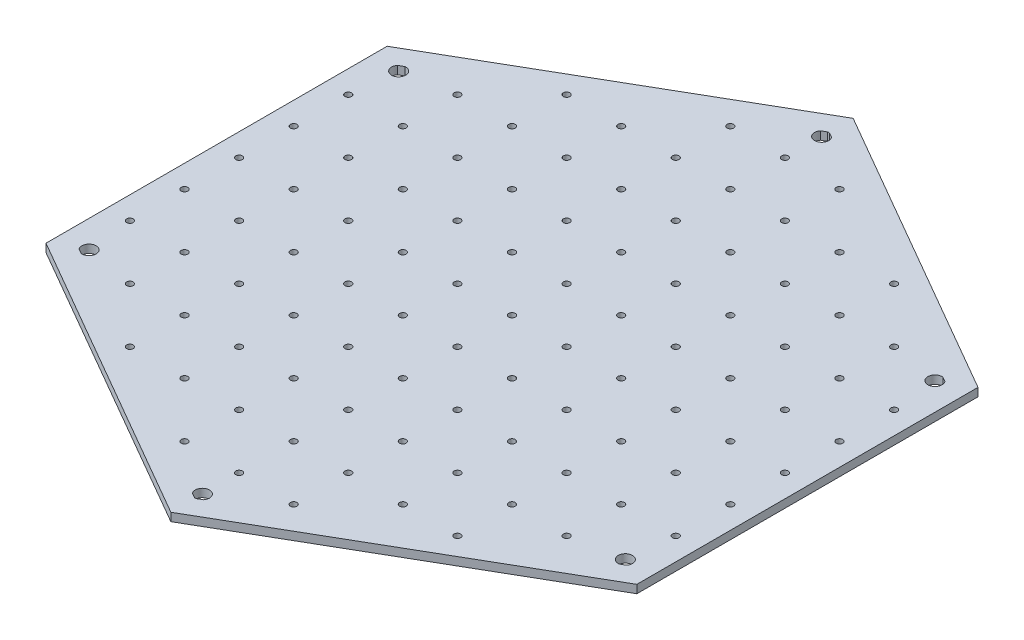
from build123d import *

# Parameters (mm, degrees)
BOSS_EXTRUDE1_DEPTH        = 1.5
SKETCH2_R                  = 0.6
CUT_EXTRUDE1_DEPTH         = 83.693334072
LPATTERN1_COUNT            = 6
LPATTERN1_PITCH            = 10
MIRROR1_COPY_1_SKETCH_R    = 0.6
MIRROR1_COPY_1_DEPTH       = 83.693334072
MIRROR1_COPY_2_SKETCH_R    = 0.6
MIRROR1_COPY_2_DEPTH       = 83.693334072
MIRROR1_COPY_3_SKETCH_R    = 0.6
MIRROR1_COPY_3_DEPTH       = 83.693334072
MIRROR1_COPY_4_SKETCH_R    = 0.6
MIRROR1_COPY_4_DEPTH       = 83.693334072
MIRROR1_COPY_5_SKETCH_R    = 0.6
MIRROR1_COPY_5_DEPTH       = 83.693334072
MIRROR1_COPY_6_SKETCH_R    = 0.6
MIRROR1_COPY_6_DEPTH       = 83.693334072
LPATTERN2_COPY_1_SKETCH_R  = 0.6
LPATTERN2_COPY_1_DEPTH     = 83.693334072
LPATTERN2_COPY_2_SKETCH_R  = 0.6
LPATTERN2_COPY_2_DEPTH     = 83.693334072
LPATTERN2_COPY_3_SKETCH_R  = 0.6
LPATTERN2_COPY_3_DEPTH     = 83.693334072
LPATTERN2_COPY_4_SKETCH_R  = 0.6
LPATTERN2_COPY_4_DEPTH     = 83.693334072
LPATTERN2_COPY_5_SKETCH_R  = 0.6
LPATTERN2_COPY_5_DEPTH     = 83.693334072
LPATTERN2_COPY_6_SKETCH_R  = 0.6
LPATTERN2_COPY_6_DEPTH     = 83.693334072
LPATTERN2_COPY_7_SKETCH_R  = 0.6
LPATTERN2_COPY_7_DEPTH     = 83.693334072
LPATTERN2_COPY_8_SKETCH_R  = 0.6
LPATTERN2_COPY_8_DEPTH     = 83.693334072
LPATTERN2_COPY_9_SKETCH_R  = 0.6
LPATTERN2_COPY_9_DEPTH     = 83.693334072
LPATTERN2_COPY_10_SKETCH_R = 0.6
LPATTERN2_COPY_10_DEPTH    = 83.693334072
LPATTERN2_COPY_11_SKETCH_R = 0.6
LPATTERN2_COPY_11_DEPTH    = 83.693334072
LPATTERN2_COPY_12_SKETCH_R = 0.6
LPATTERN2_COPY_12_DEPTH    = 83.693334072
LPATTERN2_COPY_13_SKETCH_R = 0.6
LPATTERN2_COPY_13_DEPTH    = 83.693334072
LPATTERN2_COPY_14_SKETCH_R = 0.6
LPATTERN2_COPY_14_DEPTH    = 83.693334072
LPATTERN2_COPY_15_SKETCH_R = 0.6
LPATTERN2_COPY_15_DEPTH    = 83.693334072
LPATTERN2_COPY_16_SKETCH_R = 0.6
LPATTERN2_COPY_16_DEPTH    = 83.693334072
LPATTERN2_COPY_17_SKETCH_R = 0.6
LPATTERN2_COPY_17_DEPTH    = 83.693334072
LPATTERN2_COPY_18_SKETCH_R = 0.6
LPATTERN2_COPY_18_DEPTH    = 83.693334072
LPATTERN2_COPY_19_SKETCH_R = 0.6
LPATTERN2_COPY_19_DEPTH    = 83.693334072
LPATTERN2_COPY_20_SKETCH_R = 0.6
LPATTERN2_COPY_20_DEPTH    = 83.693334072
LPATTERN2_COPY_21_SKETCH_R = 0.6
LPATTERN2_COPY_21_DEPTH    = 83.693334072
LPATTERN2_COPY_22_SKETCH_R = 0.6
LPATTERN2_COPY_22_DEPTH    = 83.693334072
LPATTERN2_COPY_23_SKETCH_R = 0.6
LPATTERN2_COPY_23_DEPTH    = 83.693334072
LPATTERN2_COPY_24_SKETCH_R = 0.6
LPATTERN2_COPY_24_DEPTH    = 83.693334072
LPATTERN2_COPY_25_SKETCH_R = 0.6
LPATTERN2_COPY_25_DEPTH    = 83.693334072
LPATTERN2_COPY_26_SKETCH_R = 0.6
LPATTERN2_COPY_26_DEPTH    = 83.693334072
LPATTERN2_COPY_27_SKETCH_R = 0.6
LPATTERN2_COPY_27_DEPTH    = 83.693334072
LPATTERN2_COPY_28_SKETCH_R = 0.6
LPATTERN2_COPY_28_DEPTH    = 83.693334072
LPATTERN2_COPY_29_SKETCH_R = 0.6
LPATTERN2_COPY_29_DEPTH    = 83.693334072
LPATTERN2_COPY_30_SKETCH_R = 0.6
LPATTERN2_COPY_30_DEPTH    = 83.693334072
LPATTERN2_COPY_31_SKETCH_R = 0.6
LPATTERN2_COPY_31_DEPTH    = 83.693334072
LPATTERN2_COPY_32_SKETCH_R = 0.6
LPATTERN2_COPY_32_DEPTH    = 83.693334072
LPATTERN2_COPY_33_SKETCH_R = 0.6
LPATTERN2_COPY_33_DEPTH    = 83.693334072
LPATTERN2_COPY_34_SKETCH_R = 0.6
LPATTERN2_COPY_34_DEPTH    = 83.693334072
LPATTERN2_COPY_35_SKETCH_R = 0.6
LPATTERN2_COPY_35_DEPTH    = 83.693334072
LPATTERN2_COPY_36_SKETCH_R = 0.6
LPATTERN2_COPY_36_DEPTH    = 83.693334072
LPATTERN2_COPY_37_SKETCH_R = 0.6
LPATTERN2_COPY_37_DEPTH    = 83.693334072
LPATTERN2_COPY_38_SKETCH_R = 0.6
LPATTERN2_COPY_38_DEPTH    = 83.693334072
LPATTERN2_COPY_39_SKETCH_R = 0.6
LPATTERN2_COPY_39_DEPTH    = 83.693334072
LPATTERN2_COPY_40_SKETCH_R = 0.6
LPATTERN2_COPY_40_DEPTH    = 83.693334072
LPATTERN2_COPY_41_SKETCH_R = 0.6
LPATTERN2_COPY_41_DEPTH    = 83.693334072
LPATTERN2_COPY_42_SKETCH_R = 0.6
LPATTERN2_COPY_42_DEPTH    = 83.693334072
LPATTERN2_COPY_43_SKETCH_R = 0.6
LPATTERN2_COPY_43_DEPTH    = 83.693334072
LPATTERN2_COPY_44_SKETCH_R = 0.6
LPATTERN2_COPY_44_DEPTH    = 83.693334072
LPATTERN2_COPY_45_SKETCH_R = 0.6
LPATTERN2_COPY_45_DEPTH    = 83.693334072
LPATTERN2_COPY_46_SKETCH_R = 0.6
LPATTERN2_COPY_46_DEPTH    = 83.693334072
LPATTERN2_COPY_47_SKETCH_R = 0.6
LPATTERN2_COPY_47_DEPTH    = 83.693334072
LPATTERN2_COPY_48_SKETCH_R = 0.6
LPATTERN2_COPY_48_DEPTH    = 83.693334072
LPATTERN2_COPY_49_SKETCH_R = 0.6
LPATTERN2_COPY_49_DEPTH    = 83.693334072
LPATTERN2_COPY_50_SKETCH_R = 0.6
LPATTERN2_COPY_50_DEPTH    = 83.693334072
LPATTERN2_COPY_51_SKETCH_R = 0.6
LPATTERN2_COPY_51_DEPTH    = 83.693334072
LPATTERN2_COPY_52_SKETCH_R = 0.6
LPATTERN2_COPY_52_DEPTH    = 83.693334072
LPATTERN2_COPY_53_SKETCH_R = 0.6
LPATTERN2_COPY_53_DEPTH    = 83.693334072
LPATTERN2_COPY_54_SKETCH_R = 0.6
LPATTERN2_COPY_54_DEPTH    = 83.693334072
LPATTERN2_COPY_55_SKETCH_R = 0.6
LPATTERN2_COPY_55_DEPTH    = 83.693334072
LPATTERN2_COPY_56_SKETCH_R = 0.6
LPATTERN2_COPY_56_DEPTH    = 83.693334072
LPATTERN2_COPY_57_SKETCH_R = 0.6
LPATTERN2_COPY_57_DEPTH    = 83.693334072
LPATTERN2_COPY_58_SKETCH_R = 0.6
LPATTERN2_COPY_58_DEPTH    = 83.693334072
LPATTERN2_COPY_59_SKETCH_R = 0.6
LPATTERN2_COPY_59_DEPTH    = 83.693334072
LPATTERN2_COPY_60_SKETCH_R = 0.6
LPATTERN2_COPY_60_DEPTH    = 83.693334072
LPATTERN2_COPY_61_SKETCH_R = 0.6
LPATTERN2_COPY_61_DEPTH    = 83.693334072
LPATTERN2_COPY_62_SKETCH_R = 0.6
LPATTERN2_COPY_62_DEPTH    = 83.693334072
LPATTERN2_COPY_63_SKETCH_R = 0.6
LPATTERN2_COPY_63_DEPTH    = 83.693334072
LPATTERN2_COPY_64_SKETCH_R = 0.6
LPATTERN2_COPY_64_DEPTH    = 83.693334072
LPATTERN2_COPY_65_SKETCH_R = 0.6
LPATTERN2_COPY_65_DEPTH    = 83.693334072
LPATTERN2_COPY_66_SKETCH_R = 0.6
LPATTERN2_COPY_66_DEPTH    = 83.693334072
LPATTERN2_COPY_67_SKETCH_R = 0.6
LPATTERN2_COPY_67_DEPTH    = 83.693334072
LPATTERN2_COPY_68_SKETCH_R = 0.6
LPATTERN2_COPY_68_DEPTH    = 83.693334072
LPATTERN2_COPY_69_SKETCH_R = 0.6
LPATTERN2_COPY_69_DEPTH    = 83.693334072
LPATTERN2_COPY_70_SKETCH_R = 0.6
LPATTERN2_COPY_70_DEPTH    = 83.693334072
LPATTERN2_COPY_71_SKETCH_R = 0.6
LPATTERN2_COPY_71_DEPTH    = 83.693334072
LPATTERN2_COPY_72_SKETCH_R = 0.6
LPATTERN2_COPY_72_DEPTH    = 83.693334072
LPATTERN2_COPY_73_SKETCH_R = 0.6
LPATTERN2_COPY_73_DEPTH    = 83.693334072
LPATTERN2_COPY_74_SKETCH_R = 0.6
LPATTERN2_COPY_74_DEPTH    = 83.693334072
LPATTERN2_COPY_75_SKETCH_R = 0.6
LPATTERN2_COPY_75_DEPTH    = 83.693334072
LPATTERN2_COPY_76_SKETCH_R = 0.6
LPATTERN2_COPY_76_DEPTH    = 83.693334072
LPATTERN2_COPY_77_SKETCH_R = 0.6
LPATTERN2_COPY_77_DEPTH    = 83.693334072
LPATTERN2_COPY_78_SKETCH_R = 0.6
LPATTERN2_COPY_78_DEPTH    = 83.693334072
MIRROR2_COPY_1_SKETCH_R    = 0.6
MIRROR2_COPY_1_DEPTH       = 83.693334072
MIRROR2_COPY_2_SKETCH_R    = 0.6
MIRROR2_COPY_2_DEPTH       = 83.693334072
MIRROR2_COPY_3_SKETCH_R    = 0.6
MIRROR2_COPY_3_DEPTH       = 83.693334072
MIRROR2_COPY_4_SKETCH_R    = 0.6
MIRROR2_COPY_4_DEPTH       = 83.693334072
MIRROR2_COPY_5_SKETCH_R    = 0.6
MIRROR2_COPY_5_DEPTH       = 83.693334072
MIRROR2_COPY_6_SKETCH_R    = 0.6
MIRROR2_COPY_6_DEPTH       = 83.693334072
MIRROR2_COPY_7_SKETCH_R    = 0.6
MIRROR2_COPY_7_DEPTH       = 83.693334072
MIRROR2_COPY_8_SKETCH_R    = 0.6
MIRROR2_COPY_8_DEPTH       = 83.693334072
MIRROR2_COPY_9_SKETCH_R    = 0.6
MIRROR2_COPY_9_DEPTH       = 83.693334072
MIRROR2_COPY_10_SKETCH_R   = 0.6
MIRROR2_COPY_10_DEPTH      = 83.693334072
MIRROR2_COPY_11_SKETCH_R   = 0.6
MIRROR2_COPY_11_DEPTH      = 83.693334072
MIRROR2_COPY_12_SKETCH_R   = 0.6
MIRROR2_COPY_12_DEPTH      = 83.693334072
MIRROR2_COPY_13_SKETCH_R   = 0.6
MIRROR2_COPY_13_DEPTH      = 83.693334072
MIRROR2_COPY_14_SKETCH_R   = 0.6
MIRROR2_COPY_14_DEPTH      = 83.693334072
MIRROR2_COPY_15_SKETCH_R   = 0.6
MIRROR2_COPY_15_DEPTH      = 83.693334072
MIRROR2_COPY_16_SKETCH_R   = 0.6
MIRROR2_COPY_16_DEPTH      = 83.693334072
MIRROR2_COPY_17_SKETCH_R   = 0.6
MIRROR2_COPY_17_DEPTH      = 83.693334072
MIRROR2_COPY_18_SKETCH_R   = 0.6
MIRROR2_COPY_18_DEPTH      = 83.693334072
MIRROR2_COPY_19_SKETCH_R   = 0.6
MIRROR2_COPY_19_DEPTH      = 83.693334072
MIRROR2_COPY_20_SKETCH_R   = 0.6
MIRROR2_COPY_20_DEPTH      = 83.693334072
MIRROR2_COPY_21_SKETCH_R   = 0.6
MIRROR2_COPY_21_DEPTH      = 83.693334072
MIRROR2_COPY_22_SKETCH_R   = 0.6
MIRROR2_COPY_22_DEPTH      = 83.693334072
MIRROR2_COPY_23_SKETCH_R   = 0.6
MIRROR2_COPY_23_DEPTH      = 83.693334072
MIRROR2_COPY_24_SKETCH_R   = 0.6
MIRROR2_COPY_24_DEPTH      = 83.693334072
MIRROR2_COPY_25_SKETCH_R   = 0.6
MIRROR2_COPY_25_DEPTH      = 83.693334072
MIRROR2_COPY_26_SKETCH_R   = 0.6
MIRROR2_COPY_26_DEPTH      = 83.693334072
MIRROR2_COPY_27_SKETCH_R   = 0.6
MIRROR2_COPY_27_DEPTH      = 83.693334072
MIRROR2_COPY_28_SKETCH_R   = 0.6
MIRROR2_COPY_28_DEPTH      = 83.693334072
MIRROR2_COPY_29_SKETCH_R   = 0.6
MIRROR2_COPY_29_DEPTH      = 83.693334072
MIRROR2_COPY_30_SKETCH_R   = 0.6
MIRROR2_COPY_30_DEPTH      = 83.693334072
MIRROR2_COPY_31_SKETCH_R   = 0.6
MIRROR2_COPY_31_DEPTH      = 83.693334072
MIRROR2_COPY_32_SKETCH_R   = 0.6
MIRROR2_COPY_32_DEPTH      = 83.693334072
MIRROR2_COPY_33_SKETCH_R   = 0.6
MIRROR2_COPY_33_DEPTH      = 83.693334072
MIRROR2_COPY_34_SKETCH_R   = 0.6
MIRROR2_COPY_34_DEPTH      = 83.693334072
MIRROR2_COPY_35_SKETCH_R   = 0.6
MIRROR2_COPY_35_DEPTH      = 83.693334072
MIRROR2_COPY_36_SKETCH_R   = 0.6
MIRROR2_COPY_36_DEPTH      = 83.693334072
MIRROR2_COPY_37_SKETCH_R   = 0.6
MIRROR2_COPY_37_DEPTH      = 83.693334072
MIRROR2_COPY_38_SKETCH_R   = 0.6
MIRROR2_COPY_38_DEPTH      = 83.693334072
MIRROR2_COPY_39_SKETCH_R   = 0.6
MIRROR2_COPY_39_DEPTH      = 83.693334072
MIRROR2_COPY_40_SKETCH_R   = 0.6
MIRROR2_COPY_40_DEPTH      = 83.693334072
MIRROR2_COPY_41_SKETCH_R   = 0.6
MIRROR2_COPY_41_DEPTH      = 83.693334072
MIRROR2_COPY_42_SKETCH_R   = 0.6
MIRROR2_COPY_42_DEPTH      = 83.693334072
MIRROR2_COPY_43_SKETCH_R   = 0.6
MIRROR2_COPY_43_DEPTH      = 83.693334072
MIRROR2_COPY_44_SKETCH_R   = 0.6
MIRROR2_COPY_44_DEPTH      = 83.693334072
MIRROR2_COPY_45_SKETCH_R   = 0.6
MIRROR2_COPY_45_DEPTH      = 83.693334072
MIRROR2_COPY_46_SKETCH_R   = 0.6
MIRROR2_COPY_46_DEPTH      = 83.693334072
MIRROR2_COPY_47_SKETCH_R   = 0.6
MIRROR2_COPY_47_DEPTH      = 83.693334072
MIRROR2_COPY_48_SKETCH_R   = 0.6
MIRROR2_COPY_48_DEPTH      = 83.693334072
MIRROR2_COPY_49_SKETCH_R   = 0.6
MIRROR2_COPY_49_DEPTH      = 83.693334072
MIRROR2_COPY_50_SKETCH_R   = 0.6
MIRROR2_COPY_50_DEPTH      = 83.693334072
MIRROR2_COPY_51_SKETCH_R   = 0.6
MIRROR2_COPY_51_DEPTH      = 83.693334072
MIRROR2_COPY_52_SKETCH_R   = 0.6
MIRROR2_COPY_52_DEPTH      = 83.693334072
MIRROR2_COPY_53_SKETCH_R   = 0.6
MIRROR2_COPY_53_DEPTH      = 83.693334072
MIRROR2_COPY_54_SKETCH_R   = 0.6
MIRROR2_COPY_54_DEPTH      = 83.693334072
MIRROR2_COPY_55_SKETCH_R   = 0.6
MIRROR2_COPY_55_DEPTH      = 83.693334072
MIRROR2_COPY_56_SKETCH_R   = 0.6
MIRROR2_COPY_56_DEPTH      = 83.693334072
MIRROR2_COPY_57_SKETCH_R   = 0.6
MIRROR2_COPY_57_DEPTH      = 83.693334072
MIRROR2_COPY_58_SKETCH_R   = 0.6
MIRROR2_COPY_58_DEPTH      = 83.693334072
MIRROR2_COPY_59_SKETCH_R   = 0.6
MIRROR2_COPY_59_DEPTH      = 83.693334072
MIRROR2_COPY_60_SKETCH_R   = 0.6
MIRROR2_COPY_60_DEPTH      = 83.693334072
MIRROR2_COPY_61_SKETCH_R   = 0.6
MIRROR2_COPY_61_DEPTH      = 83.693334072
MIRROR2_COPY_62_SKETCH_R   = 0.6
MIRROR2_COPY_62_DEPTH      = 83.693334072
MIRROR2_COPY_63_SKETCH_R   = 0.6
MIRROR2_COPY_63_DEPTH      = 83.693334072
MIRROR2_COPY_64_SKETCH_R   = 0.6
MIRROR2_COPY_64_DEPTH      = 83.693334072
MIRROR2_COPY_65_SKETCH_R   = 0.6
MIRROR2_COPY_65_DEPTH      = 83.693334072
MIRROR2_COPY_66_SKETCH_R   = 0.6
MIRROR2_COPY_66_DEPTH      = 83.693334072
MIRROR2_COPY_67_SKETCH_R   = 0.6
MIRROR2_COPY_67_DEPTH      = 83.693334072
MIRROR2_COPY_68_SKETCH_R   = 0.6
MIRROR2_COPY_68_DEPTH      = 83.693334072
MIRROR2_COPY_69_SKETCH_R   = 0.6
MIRROR2_COPY_69_DEPTH      = 83.693334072
MIRROR2_COPY_70_SKETCH_R   = 0.6
MIRROR2_COPY_70_DEPTH      = 83.693334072
MIRROR2_COPY_71_SKETCH_R   = 0.6
MIRROR2_COPY_71_DEPTH      = 83.693334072
MIRROR2_COPY_72_SKETCH_R   = 0.6
MIRROR2_COPY_72_DEPTH      = 83.693334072
MIRROR2_COPY_73_SKETCH_R   = 0.6
MIRROR2_COPY_73_DEPTH      = 83.693334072
MIRROR2_COPY_74_SKETCH_R   = 0.6
MIRROR2_COPY_74_DEPTH      = 83.693334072
MIRROR2_COPY_75_SKETCH_R   = 0.6
MIRROR2_COPY_75_DEPTH      = 83.693334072
MIRROR2_COPY_76_SKETCH_R   = 0.6
MIRROR2_COPY_76_DEPTH      = 83.693334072
MIRROR2_COPY_77_SKETCH_R   = 0.6
MIRROR2_COPY_77_DEPTH      = 83.693334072
MIRROR2_COPY_78_SKETCH_R   = 0.6
MIRROR2_COPY_78_DEPTH      = 83.693334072
MIRROR2_COPY_79_SKETCH_R   = 0.6
MIRROR2_COPY_79_DEPTH      = 83.693334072
SKETCH4_R                  = 1.3
CUT_EXTRUDE3_DEPTH         = 83.693334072
BOSS_EXTRUDE2_DEPTH        = 1.5
BOSS_EXTRUDE3_DEPTH        = 1.5
BOSS_EXTRUDE4_DEPTH        = 1.5


with BuildPart() as part:
    # Sketch1 → Boss-Extrude1 (new body)
    with BuildSketch(Plane(origin=(0, 0, 0), x_dir=(1, 0, 0), z_dir=(0, 1, 0))):
        Polygon((0, 62.5), (-54.126587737, 31.25), (-54.126587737, -31.25), (0, -62.5), (54.126587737, -31.25), (54.126587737, 31.25), align=None)
    extrude(amount=BOSS_EXTRUDE1_DEPTH)

    # Sketch2 → Cut-Extrude1 (cut, through all)
    with BuildSketch(Plane(origin=(0, 1.5, 0), x_dir=(1, 0, 0), z_dir=(0, 1, 0))):
        with Locations(Location((0, 0, 0), (0, 0, 270))):
            Circle(SKETCH2_R)
    cut_extrude1 = extrude(amount=-CUT_EXTRUDE1_DEPTH, mode=Mode.SUBTRACT)

    # LPattern1: Cut-Extrude1 ×6
    with Locations(*[(-i * LPATTERN1_PITCH, 0, 0) for i in range(1, LPATTERN1_COUNT)]):
        add(cut_extrude1, mode=Mode.SUBTRACT)

    # Mirror1 copy 1 sketch → Mirror1 copy 1 (cut, through all)
    with BuildSketch(Plane(origin=(10, 1.5, 0), x_dir=(-1, 0, 0), z_dir=(0, 1, 0))):
        Circle(MIRROR1_COPY_1_SKETCH_R)
    extrude(amount=-MIRROR1_COPY_1_DEPTH, mode=Mode.SUBTRACT)

    # Mirror1 copy 2 sketch → Mirror1 copy 2 (cut, through all)
    with BuildSketch(Plane(origin=(20, 1.5, 0), x_dir=(-1, 0, 0), z_dir=(0, 1, 0))):
        Circle(MIRROR1_COPY_2_SKETCH_R)
    extrude(amount=-MIRROR1_COPY_2_DEPTH, mode=Mode.SUBTRACT)

    # Mirror1 copy 3 sketch → Mirror1 copy 3 (cut, through all)
    with BuildSketch(Plane(origin=(30, 1.5, 0), x_dir=(-1, 0, 0), z_dir=(0, 1, 0))):
        Circle(MIRROR1_COPY_3_SKETCH_R)
    extrude(amount=-MIRROR1_COPY_3_DEPTH, mode=Mode.SUBTRACT)

    # Mirror1 copy 4 sketch → Mirror1 copy 4 (cut, through all)
    with BuildSketch(Plane(origin=(40, 1.5, 0), x_dir=(-1, 0, 0), z_dir=(0, 1, 0))):
        Circle(MIRROR1_COPY_4_SKETCH_R)
    extrude(amount=-MIRROR1_COPY_4_DEPTH, mode=Mode.SUBTRACT)

    # Mirror1 copy 5 sketch → Mirror1 copy 5 (cut, through all)
    with BuildSketch(Plane(origin=(50, 1.5, 0), x_dir=(-1, 0, 0), z_dir=(0, 1, 0))):
        Circle(MIRROR1_COPY_5_SKETCH_R)
    extrude(amount=-MIRROR1_COPY_5_DEPTH, mode=Mode.SUBTRACT)

    # Mirror1 copy 6 sketch → Mirror1 copy 6 (cut, through all)
    with BuildSketch(Plane(origin=(0, 1.5, 0), x_dir=(-1, 0, 0), z_dir=(0, 1, 0))):
        Circle(MIRROR1_COPY_6_SKETCH_R)
    extrude(amount=-MIRROR1_COPY_6_DEPTH, mode=Mode.SUBTRACT)

    # LPattern2 copy 1 sketch → LPattern2 copy 1 (cut, through all)
    with BuildSketch(Plane(origin=(-10, 1.5, 10), x_dir=(1, 0, 0), z_dir=(0, 1, 0))):
        with Locations(Location((0, 0, 0), (0, 0, 270))):
            Circle(LPATTERN2_COPY_1_SKETCH_R)
    extrude(amount=-LPATTERN2_COPY_1_DEPTH, mode=Mode.SUBTRACT)

    # LPattern2 copy 2 sketch → LPattern2 copy 2 (cut, through all)
    with BuildSketch(Plane(origin=(-10, 1.5, 20), x_dir=(1, 0, 0), z_dir=(0, 1, 0))):
        with Locations(Location((0, 0, 0), (0, 0, 270))):
            Circle(LPATTERN2_COPY_2_SKETCH_R)
    extrude(amount=-LPATTERN2_COPY_2_DEPTH, mode=Mode.SUBTRACT)

    # LPattern2 copy 3 sketch → LPattern2 copy 3 (cut, through all)
    with BuildSketch(Plane(origin=(-10, 1.5, 30), x_dir=(1, 0, 0), z_dir=(0, 1, 0))):
        with Locations(Location((0, 0, 0), (0, 0, 270))):
            Circle(LPATTERN2_COPY_3_SKETCH_R)
    extrude(amount=-LPATTERN2_COPY_3_DEPTH, mode=Mode.SUBTRACT)

    # LPattern2 copy 4 sketch → LPattern2 copy 4 (cut, through all)
    with BuildSketch(Plane(origin=(-10, 1.5, 40), x_dir=(1, 0, 0), z_dir=(0, 1, 0))):
        with Locations(Location((0, 0, 0), (0, 0, 270))):
            Circle(LPATTERN2_COPY_4_SKETCH_R)
    extrude(amount=-LPATTERN2_COPY_4_DEPTH, mode=Mode.SUBTRACT)

    # LPattern2 copy 5 sketch → LPattern2 copy 5 (cut, through all)
    with BuildSketch(Plane(origin=(-10, 1.5, 50), x_dir=(1, 0, 0), z_dir=(0, 1, 0))):
        with Locations(Location((0, 0, 0), (0, 0, 270))):
            Circle(LPATTERN2_COPY_5_SKETCH_R)
    extrude(amount=-LPATTERN2_COPY_5_DEPTH, mode=Mode.SUBTRACT)

    # LPattern2 copy 6 sketch → LPattern2 copy 6 (cut, through all)
    with BuildSketch(Plane(origin=(-10, 1.5, 60), x_dir=(1, 0, 0), z_dir=(0, 1, 0))):
        with Locations(Location((0, 0, 0), (0, 0, 270))):
            Circle(LPATTERN2_COPY_6_SKETCH_R)
    extrude(amount=-LPATTERN2_COPY_6_DEPTH, mode=Mode.SUBTRACT)

    # LPattern2 copy 7 sketch → LPattern2 copy 7 (cut, through all)
    with BuildSketch(Plane(origin=(-20, 1.5, 10), x_dir=(1, 0, 0), z_dir=(0, 1, 0))):
        with Locations(Location((0, 0, 0), (0, 0, 270))):
            Circle(LPATTERN2_COPY_7_SKETCH_R)
    extrude(amount=-LPATTERN2_COPY_7_DEPTH, mode=Mode.SUBTRACT)

    # LPattern2 copy 8 sketch → LPattern2 copy 8 (cut, through all)
    with BuildSketch(Plane(origin=(-20, 1.5, 20), x_dir=(1, 0, 0), z_dir=(0, 1, 0))):
        with Locations(Location((0, 0, 0), (0, 0, 270))):
            Circle(LPATTERN2_COPY_8_SKETCH_R)
    extrude(amount=-LPATTERN2_COPY_8_DEPTH, mode=Mode.SUBTRACT)

    # LPattern2 copy 9 sketch → LPattern2 copy 9 (cut, through all)
    with BuildSketch(Plane(origin=(-20, 1.5, 30), x_dir=(1, 0, 0), z_dir=(0, 1, 0))):
        with Locations(Location((0, 0, 0), (0, 0, 270))):
            Circle(LPATTERN2_COPY_9_SKETCH_R)
    extrude(amount=-LPATTERN2_COPY_9_DEPTH, mode=Mode.SUBTRACT)

    # LPattern2 copy 10 sketch → LPattern2 copy 10 (cut, through all)
    with BuildSketch(Plane(origin=(-20, 1.5, 40), x_dir=(1, 0, 0), z_dir=(0, 1, 0))):
        with Locations(Location((0, 0, 0), (0, 0, 270))):
            Circle(LPATTERN2_COPY_10_SKETCH_R)
    extrude(amount=-LPATTERN2_COPY_10_DEPTH, mode=Mode.SUBTRACT)

    # LPattern2 copy 11 sketch → LPattern2 copy 11 (cut, through all)
    with BuildSketch(Plane(origin=(-20, 1.5, 50), x_dir=(1, 0, 0), z_dir=(0, 1, 0))):
        with Locations(Location((0, 0, 0), (0, 0, 270))):
            Circle(LPATTERN2_COPY_11_SKETCH_R)
    extrude(amount=-LPATTERN2_COPY_11_DEPTH, mode=Mode.SUBTRACT)

    # LPattern2 copy 12 sketch → LPattern2 copy 12 (cut, through all)
    with BuildSketch(Plane(origin=(-20, 1.5, 60), x_dir=(1, 0, 0), z_dir=(0, 1, 0))):
        with Locations(Location((0, 0, 0), (0, 0, 270))):
            Circle(LPATTERN2_COPY_12_SKETCH_R)
    extrude(amount=-LPATTERN2_COPY_12_DEPTH, mode=Mode.SUBTRACT)

    # LPattern2 copy 13 sketch → LPattern2 copy 13 (cut, through all)
    with BuildSketch(Plane(origin=(-30, 1.5, 10), x_dir=(1, 0, 0), z_dir=(0, 1, 0))):
        with Locations(Location((0, 0, 0), (0, 0, 270))):
            Circle(LPATTERN2_COPY_13_SKETCH_R)
    extrude(amount=-LPATTERN2_COPY_13_DEPTH, mode=Mode.SUBTRACT)

    # LPattern2 copy 14 sketch → LPattern2 copy 14 (cut, through all)
    with BuildSketch(Plane(origin=(-30, 1.5, 20), x_dir=(1, 0, 0), z_dir=(0, 1, 0))):
        with Locations(Location((0, 0, 0), (0, 0, 270))):
            Circle(LPATTERN2_COPY_14_SKETCH_R)
    extrude(amount=-LPATTERN2_COPY_14_DEPTH, mode=Mode.SUBTRACT)

    # LPattern2 copy 15 sketch → LPattern2 copy 15 (cut, through all)
    with BuildSketch(Plane(origin=(-30, 1.5, 30), x_dir=(1, 0, 0), z_dir=(0, 1, 0))):
        with Locations(Location((0, 0, 0), (0, 0, 270))):
            Circle(LPATTERN2_COPY_15_SKETCH_R)
    extrude(amount=-LPATTERN2_COPY_15_DEPTH, mode=Mode.SUBTRACT)

    # LPattern2 copy 16 sketch → LPattern2 copy 16 (cut, through all)
    with BuildSketch(Plane(origin=(-30, 1.5, 40), x_dir=(1, 0, 0), z_dir=(0, 1, 0))):
        with Locations(Location((0, 0, 0), (0, 0, 270))):
            Circle(LPATTERN2_COPY_16_SKETCH_R)
    extrude(amount=-LPATTERN2_COPY_16_DEPTH, mode=Mode.SUBTRACT)

    # LPattern2 copy 17 sketch → LPattern2 copy 17 (cut, through all)
    with BuildSketch(Plane(origin=(-30, 1.5, 50), x_dir=(1, 0, 0), z_dir=(0, 1, 0))):
        with Locations(Location((0, 0, 0), (0, 0, 270))):
            Circle(LPATTERN2_COPY_17_SKETCH_R)
    extrude(amount=-LPATTERN2_COPY_17_DEPTH, mode=Mode.SUBTRACT)

    # LPattern2 copy 18 sketch → LPattern2 copy 18 (cut, through all)
    with BuildSketch(Plane(origin=(-30, 1.5, 60), x_dir=(1, 0, 0), z_dir=(0, 1, 0))):
        with Locations(Location((0, 0, 0), (0, 0, 270))):
            Circle(LPATTERN2_COPY_18_SKETCH_R)
    extrude(amount=-LPATTERN2_COPY_18_DEPTH, mode=Mode.SUBTRACT)

    # LPattern2 copy 19 sketch → LPattern2 copy 19 (cut, through all)
    with BuildSketch(Plane(origin=(-40, 1.5, 10), x_dir=(1, 0, 0), z_dir=(0, 1, 0))):
        with Locations(Location((0, 0, 0), (0, 0, 270))):
            Circle(LPATTERN2_COPY_19_SKETCH_R)
    extrude(amount=-LPATTERN2_COPY_19_DEPTH, mode=Mode.SUBTRACT)

    # LPattern2 copy 20 sketch → LPattern2 copy 20 (cut, through all)
    with BuildSketch(Plane(origin=(-40, 1.5, 20), x_dir=(1, 0, 0), z_dir=(0, 1, 0))):
        with Locations(Location((0, 0, 0), (0, 0, 270))):
            Circle(LPATTERN2_COPY_20_SKETCH_R)
    extrude(amount=-LPATTERN2_COPY_20_DEPTH, mode=Mode.SUBTRACT)

    # LPattern2 copy 21 sketch → LPattern2 copy 21 (cut, through all)
    with BuildSketch(Plane(origin=(-40, 1.5, 30), x_dir=(1, 0, 0), z_dir=(0, 1, 0))):
        with Locations(Location((0, 0, 0), (0, 0, 270))):
            Circle(LPATTERN2_COPY_21_SKETCH_R)
    extrude(amount=-LPATTERN2_COPY_21_DEPTH, mode=Mode.SUBTRACT)

    # LPattern2 copy 22 sketch → LPattern2 copy 22 (cut, through all)
    with BuildSketch(Plane(origin=(-40, 1.5, 40), x_dir=(1, 0, 0), z_dir=(0, 1, 0))):
        with Locations(Location((0, 0, 0), (0, 0, 270))):
            Circle(LPATTERN2_COPY_22_SKETCH_R)
    extrude(amount=-LPATTERN2_COPY_22_DEPTH, mode=Mode.SUBTRACT)

    # LPattern2 copy 23 sketch → LPattern2 copy 23 (cut, through all)
    with BuildSketch(Plane(origin=(-40, 1.5, 50), x_dir=(1, 0, 0), z_dir=(0, 1, 0))):
        with Locations(Location((0, 0, 0), (0, 0, 270))):
            Circle(LPATTERN2_COPY_23_SKETCH_R)
    extrude(amount=-LPATTERN2_COPY_23_DEPTH, mode=Mode.SUBTRACT)

    # LPattern2 copy 24 sketch → LPattern2 copy 24 (cut, through all)
    with BuildSketch(Plane(origin=(-40, 1.5, 60), x_dir=(1, 0, 0), z_dir=(0, 1, 0))):
        with Locations(Location((0, 0, 0), (0, 0, 270))):
            Circle(LPATTERN2_COPY_24_SKETCH_R)
    extrude(amount=-LPATTERN2_COPY_24_DEPTH, mode=Mode.SUBTRACT)

    # LPattern2 copy 25 sketch → LPattern2 copy 25 (cut, through all)
    with BuildSketch(Plane(origin=(-50, 1.5, 10), x_dir=(1, 0, 0), z_dir=(0, 1, 0))):
        with Locations(Location((0, 0, 0), (0, 0, 270))):
            Circle(LPATTERN2_COPY_25_SKETCH_R)
    extrude(amount=-LPATTERN2_COPY_25_DEPTH, mode=Mode.SUBTRACT)

    # LPattern2 copy 26 sketch → LPattern2 copy 26 (cut, through all)
    with BuildSketch(Plane(origin=(-50, 1.5, 20), x_dir=(1, 0, 0), z_dir=(0, 1, 0))):
        with Locations(Location((0, 0, 0), (0, 0, 270))):
            Circle(LPATTERN2_COPY_26_SKETCH_R)
    extrude(amount=-LPATTERN2_COPY_26_DEPTH, mode=Mode.SUBTRACT)

    # LPattern2 copy 27 sketch → LPattern2 copy 27 (cut, through all)
    with BuildSketch(Plane(origin=(-50, 1.5, 30), x_dir=(1, 0, 0), z_dir=(0, 1, 0))):
        with Locations(Location((0, 0, 0), (0, 0, 270))):
            Circle(LPATTERN2_COPY_27_SKETCH_R)
    extrude(amount=-LPATTERN2_COPY_27_DEPTH, mode=Mode.SUBTRACT)

    # LPattern2 copy 28 sketch → LPattern2 copy 28 (cut, through all)
    with BuildSketch(Plane(origin=(-50, 1.5, 40), x_dir=(1, 0, 0), z_dir=(0, 1, 0))):
        with Locations(Location((0, 0, 0), (0, 0, 270))):
            Circle(LPATTERN2_COPY_28_SKETCH_R)
    extrude(amount=-LPATTERN2_COPY_28_DEPTH, mode=Mode.SUBTRACT)

    # LPattern2 copy 29 sketch → LPattern2 copy 29 (cut, through all)
    with BuildSketch(Plane(origin=(-50, 1.5, 50), x_dir=(1, 0, 0), z_dir=(0, 1, 0))):
        with Locations(Location((0, 0, 0), (0, 0, 270))):
            Circle(LPATTERN2_COPY_29_SKETCH_R)
    extrude(amount=-LPATTERN2_COPY_29_DEPTH, mode=Mode.SUBTRACT)

    # LPattern2 copy 30 sketch → LPattern2 copy 30 (cut, through all)
    with BuildSketch(Plane(origin=(-50, 1.5, 60), x_dir=(1, 0, 0), z_dir=(0, 1, 0))):
        with Locations(Location((0, 0, 0), (0, 0, 270))):
            Circle(LPATTERN2_COPY_30_SKETCH_R)
    extrude(amount=-LPATTERN2_COPY_30_DEPTH, mode=Mode.SUBTRACT)

    # LPattern2 copy 31 sketch → LPattern2 copy 31 (cut, through all)
    with BuildSketch(Plane(origin=(0, 1.5, 10), x_dir=(1, 0, 0), z_dir=(0, 1, 0))):
        with Locations(Location((0, 0, 0), (0, 0, 270))):
            Circle(LPATTERN2_COPY_31_SKETCH_R)
    extrude(amount=-LPATTERN2_COPY_31_DEPTH, mode=Mode.SUBTRACT)

    # LPattern2 copy 32 sketch → LPattern2 copy 32 (cut, through all)
    with BuildSketch(Plane(origin=(0, 1.5, 20), x_dir=(1, 0, 0), z_dir=(0, 1, 0))):
        with Locations(Location((0, 0, 0), (0, 0, 270))):
            Circle(LPATTERN2_COPY_32_SKETCH_R)
    extrude(amount=-LPATTERN2_COPY_32_DEPTH, mode=Mode.SUBTRACT)

    # LPattern2 copy 33 sketch → LPattern2 copy 33 (cut, through all)
    with BuildSketch(Plane(origin=(0, 1.5, 30), x_dir=(1, 0, 0), z_dir=(0, 1, 0))):
        with Locations(Location((0, 0, 0), (0, 0, 270))):
            Circle(LPATTERN2_COPY_33_SKETCH_R)
    extrude(amount=-LPATTERN2_COPY_33_DEPTH, mode=Mode.SUBTRACT)

    # LPattern2 copy 34 sketch → LPattern2 copy 34 (cut, through all)
    with BuildSketch(Plane(origin=(0, 1.5, 40), x_dir=(1, 0, 0), z_dir=(0, 1, 0))):
        with Locations(Location((0, 0, 0), (0, 0, 270))):
            Circle(LPATTERN2_COPY_34_SKETCH_R)
    extrude(amount=-LPATTERN2_COPY_34_DEPTH, mode=Mode.SUBTRACT)

    # LPattern2 copy 35 sketch → LPattern2 copy 35 (cut, through all)
    with BuildSketch(Plane(origin=(0, 1.5, 50), x_dir=(1, 0, 0), z_dir=(0, 1, 0))):
        with Locations(Location((0, 0, 0), (0, 0, 270))):
            Circle(LPATTERN2_COPY_35_SKETCH_R)
    extrude(amount=-LPATTERN2_COPY_35_DEPTH, mode=Mode.SUBTRACT)

    # LPattern2 copy 36 sketch → LPattern2 copy 36 (cut, through all)
    with BuildSketch(Plane(origin=(0, 1.5, 60), x_dir=(1, 0, 0), z_dir=(0, 1, 0))):
        with Locations(Location((0, 0, 0), (0, 0, 270))):
            Circle(LPATTERN2_COPY_36_SKETCH_R)
    extrude(amount=-LPATTERN2_COPY_36_DEPTH, mode=Mode.SUBTRACT)

    # LPattern2 copy 37 sketch → LPattern2 copy 37 (cut, through all)
    with BuildSketch(Plane(origin=(10, 1.5, 10), x_dir=(-1, 0, 0), z_dir=(0, 1, 0))):
        Circle(LPATTERN2_COPY_37_SKETCH_R)
    extrude(amount=-LPATTERN2_COPY_37_DEPTH, mode=Mode.SUBTRACT)

    # LPattern2 copy 38 sketch → LPattern2 copy 38 (cut, through all)
    with BuildSketch(Plane(origin=(10, 1.5, 20), x_dir=(-1, 0, 0), z_dir=(0, 1, 0))):
        Circle(LPATTERN2_COPY_38_SKETCH_R)
    extrude(amount=-LPATTERN2_COPY_38_DEPTH, mode=Mode.SUBTRACT)

    # LPattern2 copy 39 sketch → LPattern2 copy 39 (cut, through all)
    with BuildSketch(Plane(origin=(10, 1.5, 30), x_dir=(-1, 0, 0), z_dir=(0, 1, 0))):
        Circle(LPATTERN2_COPY_39_SKETCH_R)
    extrude(amount=-LPATTERN2_COPY_39_DEPTH, mode=Mode.SUBTRACT)

    # LPattern2 copy 40 sketch → LPattern2 copy 40 (cut, through all)
    with BuildSketch(Plane(origin=(10, 1.5, 40), x_dir=(-1, 0, 0), z_dir=(0, 1, 0))):
        Circle(LPATTERN2_COPY_40_SKETCH_R)
    extrude(amount=-LPATTERN2_COPY_40_DEPTH, mode=Mode.SUBTRACT)

    # LPattern2 copy 41 sketch → LPattern2 copy 41 (cut, through all)
    with BuildSketch(Plane(origin=(10, 1.5, 50), x_dir=(-1, 0, 0), z_dir=(0, 1, 0))):
        Circle(LPATTERN2_COPY_41_SKETCH_R)
    extrude(amount=-LPATTERN2_COPY_41_DEPTH, mode=Mode.SUBTRACT)

    # LPattern2 copy 42 sketch → LPattern2 copy 42 (cut, through all)
    with BuildSketch(Plane(origin=(10, 1.5, 60), x_dir=(-1, 0, 0), z_dir=(0, 1, 0))):
        Circle(LPATTERN2_COPY_42_SKETCH_R)
    extrude(amount=-LPATTERN2_COPY_42_DEPTH, mode=Mode.SUBTRACT)

    # LPattern2 copy 43 sketch → LPattern2 copy 43 (cut, through all)
    with BuildSketch(Plane(origin=(20, 1.5, 10), x_dir=(-1, 0, 0), z_dir=(0, 1, 0))):
        Circle(LPATTERN2_COPY_43_SKETCH_R)
    extrude(amount=-LPATTERN2_COPY_43_DEPTH, mode=Mode.SUBTRACT)

    # LPattern2 copy 44 sketch → LPattern2 copy 44 (cut, through all)
    with BuildSketch(Plane(origin=(20, 1.5, 20), x_dir=(-1, 0, 0), z_dir=(0, 1, 0))):
        Circle(LPATTERN2_COPY_44_SKETCH_R)
    extrude(amount=-LPATTERN2_COPY_44_DEPTH, mode=Mode.SUBTRACT)

    # LPattern2 copy 45 sketch → LPattern2 copy 45 (cut, through all)
    with BuildSketch(Plane(origin=(20, 1.5, 30), x_dir=(-1, 0, 0), z_dir=(0, 1, 0))):
        Circle(LPATTERN2_COPY_45_SKETCH_R)
    extrude(amount=-LPATTERN2_COPY_45_DEPTH, mode=Mode.SUBTRACT)

    # LPattern2 copy 46 sketch → LPattern2 copy 46 (cut, through all)
    with BuildSketch(Plane(origin=(20, 1.5, 40), x_dir=(-1, 0, 0), z_dir=(0, 1, 0))):
        Circle(LPATTERN2_COPY_46_SKETCH_R)
    extrude(amount=-LPATTERN2_COPY_46_DEPTH, mode=Mode.SUBTRACT)

    # LPattern2 copy 47 sketch → LPattern2 copy 47 (cut, through all)
    with BuildSketch(Plane(origin=(20, 1.5, 50), x_dir=(-1, 0, 0), z_dir=(0, 1, 0))):
        Circle(LPATTERN2_COPY_47_SKETCH_R)
    extrude(amount=-LPATTERN2_COPY_47_DEPTH, mode=Mode.SUBTRACT)

    # LPattern2 copy 48 sketch → LPattern2 copy 48 (cut, through all)
    with BuildSketch(Plane(origin=(20, 1.5, 60), x_dir=(-1, 0, 0), z_dir=(0, 1, 0))):
        Circle(LPATTERN2_COPY_48_SKETCH_R)
    extrude(amount=-LPATTERN2_COPY_48_DEPTH, mode=Mode.SUBTRACT)

    # LPattern2 copy 49 sketch → LPattern2 copy 49 (cut, through all)
    with BuildSketch(Plane(origin=(30, 1.5, 10), x_dir=(-1, 0, 0), z_dir=(0, 1, 0))):
        Circle(LPATTERN2_COPY_49_SKETCH_R)
    extrude(amount=-LPATTERN2_COPY_49_DEPTH, mode=Mode.SUBTRACT)

    # LPattern2 copy 50 sketch → LPattern2 copy 50 (cut, through all)
    with BuildSketch(Plane(origin=(30, 1.5, 20), x_dir=(-1, 0, 0), z_dir=(0, 1, 0))):
        Circle(LPATTERN2_COPY_50_SKETCH_R)
    extrude(amount=-LPATTERN2_COPY_50_DEPTH, mode=Mode.SUBTRACT)

    # LPattern2 copy 51 sketch → LPattern2 copy 51 (cut, through all)
    with BuildSketch(Plane(origin=(30, 1.5, 30), x_dir=(-1, 0, 0), z_dir=(0, 1, 0))):
        Circle(LPATTERN2_COPY_51_SKETCH_R)
    extrude(amount=-LPATTERN2_COPY_51_DEPTH, mode=Mode.SUBTRACT)

    # LPattern2 copy 52 sketch → LPattern2 copy 52 (cut, through all)
    with BuildSketch(Plane(origin=(30, 1.5, 40), x_dir=(-1, 0, 0), z_dir=(0, 1, 0))):
        Circle(LPATTERN2_COPY_52_SKETCH_R)
    extrude(amount=-LPATTERN2_COPY_52_DEPTH, mode=Mode.SUBTRACT)

    # LPattern2 copy 53 sketch → LPattern2 copy 53 (cut, through all)
    with BuildSketch(Plane(origin=(30, 1.5, 50), x_dir=(-1, 0, 0), z_dir=(0, 1, 0))):
        Circle(LPATTERN2_COPY_53_SKETCH_R)
    extrude(amount=-LPATTERN2_COPY_53_DEPTH, mode=Mode.SUBTRACT)

    # LPattern2 copy 54 sketch → LPattern2 copy 54 (cut, through all)
    with BuildSketch(Plane(origin=(30, 1.5, 60), x_dir=(-1, 0, 0), z_dir=(0, 1, 0))):
        Circle(LPATTERN2_COPY_54_SKETCH_R)
    extrude(amount=-LPATTERN2_COPY_54_DEPTH, mode=Mode.SUBTRACT)

    # LPattern2 copy 55 sketch → LPattern2 copy 55 (cut, through all)
    with BuildSketch(Plane(origin=(40, 1.5, 10), x_dir=(-1, 0, 0), z_dir=(0, 1, 0))):
        Circle(LPATTERN2_COPY_55_SKETCH_R)
    extrude(amount=-LPATTERN2_COPY_55_DEPTH, mode=Mode.SUBTRACT)

    # LPattern2 copy 56 sketch → LPattern2 copy 56 (cut, through all)
    with BuildSketch(Plane(origin=(40, 1.5, 20), x_dir=(-1, 0, 0), z_dir=(0, 1, 0))):
        Circle(LPATTERN2_COPY_56_SKETCH_R)
    extrude(amount=-LPATTERN2_COPY_56_DEPTH, mode=Mode.SUBTRACT)

    # LPattern2 copy 57 sketch → LPattern2 copy 57 (cut, through all)
    with BuildSketch(Plane(origin=(40, 1.5, 30), x_dir=(-1, 0, 0), z_dir=(0, 1, 0))):
        Circle(LPATTERN2_COPY_57_SKETCH_R)
    extrude(amount=-LPATTERN2_COPY_57_DEPTH, mode=Mode.SUBTRACT)

    # LPattern2 copy 58 sketch → LPattern2 copy 58 (cut, through all)
    with BuildSketch(Plane(origin=(40, 1.5, 40), x_dir=(-1, 0, 0), z_dir=(0, 1, 0))):
        Circle(LPATTERN2_COPY_58_SKETCH_R)
    extrude(amount=-LPATTERN2_COPY_58_DEPTH, mode=Mode.SUBTRACT)

    # LPattern2 copy 59 sketch → LPattern2 copy 59 (cut, through all)
    with BuildSketch(Plane(origin=(40, 1.5, 50), x_dir=(-1, 0, 0), z_dir=(0, 1, 0))):
        Circle(LPATTERN2_COPY_59_SKETCH_R)
    extrude(amount=-LPATTERN2_COPY_59_DEPTH, mode=Mode.SUBTRACT)

    # LPattern2 copy 60 sketch → LPattern2 copy 60 (cut, through all)
    with BuildSketch(Plane(origin=(40, 1.5, 60), x_dir=(-1, 0, 0), z_dir=(0, 1, 0))):
        Circle(LPATTERN2_COPY_60_SKETCH_R)
    extrude(amount=-LPATTERN2_COPY_60_DEPTH, mode=Mode.SUBTRACT)

    # LPattern2 copy 61 sketch → LPattern2 copy 61 (cut, through all)
    with BuildSketch(Plane(origin=(50, 1.5, 10), x_dir=(-1, 0, 0), z_dir=(0, 1, 0))):
        Circle(LPATTERN2_COPY_61_SKETCH_R)
    extrude(amount=-LPATTERN2_COPY_61_DEPTH, mode=Mode.SUBTRACT)

    # LPattern2 copy 62 sketch → LPattern2 copy 62 (cut, through all)
    with BuildSketch(Plane(origin=(50, 1.5, 20), x_dir=(-1, 0, 0), z_dir=(0, 1, 0))):
        Circle(LPATTERN2_COPY_62_SKETCH_R)
    extrude(amount=-LPATTERN2_COPY_62_DEPTH, mode=Mode.SUBTRACT)

    # LPattern2 copy 63 sketch → LPattern2 copy 63 (cut, through all)
    with BuildSketch(Plane(origin=(50, 1.5, 30), x_dir=(-1, 0, 0), z_dir=(0, 1, 0))):
        Circle(LPATTERN2_COPY_63_SKETCH_R)
    extrude(amount=-LPATTERN2_COPY_63_DEPTH, mode=Mode.SUBTRACT)

    # LPattern2 copy 64 sketch → LPattern2 copy 64 (cut, through all)
    with BuildSketch(Plane(origin=(50, 1.5, 40), x_dir=(-1, 0, 0), z_dir=(0, 1, 0))):
        Circle(LPATTERN2_COPY_64_SKETCH_R)
    extrude(amount=-LPATTERN2_COPY_64_DEPTH, mode=Mode.SUBTRACT)

    # LPattern2 copy 65 sketch → LPattern2 copy 65 (cut, through all)
    with BuildSketch(Plane(origin=(50, 1.5, 50), x_dir=(-1, 0, 0), z_dir=(0, 1, 0))):
        Circle(LPATTERN2_COPY_65_SKETCH_R)
    extrude(amount=-LPATTERN2_COPY_65_DEPTH, mode=Mode.SUBTRACT)

    # LPattern2 copy 66 sketch → LPattern2 copy 66 (cut, through all)
    with BuildSketch(Plane(origin=(50, 1.5, 60), x_dir=(-1, 0, 0), z_dir=(0, 1, 0))):
        Circle(LPATTERN2_COPY_66_SKETCH_R)
    extrude(amount=-LPATTERN2_COPY_66_DEPTH, mode=Mode.SUBTRACT)

    # LPattern2 copy 67 sketch → LPattern2 copy 67 (cut, through all)
    with BuildSketch(Plane(origin=(0, 1.5, 10), x_dir=(-1, 0, 0), z_dir=(0, 1, 0))):
        Circle(LPATTERN2_COPY_67_SKETCH_R)
    extrude(amount=-LPATTERN2_COPY_67_DEPTH, mode=Mode.SUBTRACT)

    # LPattern2 copy 68 sketch → LPattern2 copy 68 (cut, through all)
    with BuildSketch(Plane(origin=(0, 1.5, 20), x_dir=(-1, 0, 0), z_dir=(0, 1, 0))):
        Circle(LPATTERN2_COPY_68_SKETCH_R)
    extrude(amount=-LPATTERN2_COPY_68_DEPTH, mode=Mode.SUBTRACT)

    # LPattern2 copy 69 sketch → LPattern2 copy 69 (cut, through all)
    with BuildSketch(Plane(origin=(0, 1.5, 30), x_dir=(-1, 0, 0), z_dir=(0, 1, 0))):
        Circle(LPATTERN2_COPY_69_SKETCH_R)
    extrude(amount=-LPATTERN2_COPY_69_DEPTH, mode=Mode.SUBTRACT)

    # LPattern2 copy 70 sketch → LPattern2 copy 70 (cut, through all)
    with BuildSketch(Plane(origin=(0, 1.5, 40), x_dir=(-1, 0, 0), z_dir=(0, 1, 0))):
        Circle(LPATTERN2_COPY_70_SKETCH_R)
    extrude(amount=-LPATTERN2_COPY_70_DEPTH, mode=Mode.SUBTRACT)

    # LPattern2 copy 71 sketch → LPattern2 copy 71 (cut, through all)
    with BuildSketch(Plane(origin=(0, 1.5, 50), x_dir=(-1, 0, 0), z_dir=(0, 1, 0))):
        Circle(LPATTERN2_COPY_71_SKETCH_R)
    extrude(amount=-LPATTERN2_COPY_71_DEPTH, mode=Mode.SUBTRACT)

    # LPattern2 copy 72 sketch → LPattern2 copy 72 (cut, through all)
    with BuildSketch(Plane(origin=(0, 1.5, 60), x_dir=(-1, 0, 0), z_dir=(0, 1, 0))):
        Circle(LPATTERN2_COPY_72_SKETCH_R)
    extrude(amount=-LPATTERN2_COPY_72_DEPTH, mode=Mode.SUBTRACT)

    # LPattern2 copy 73 sketch → LPattern2 copy 73 (cut, through all)
    with BuildSketch(Plane(origin=(0, 1.5, 10), x_dir=(1, 0, 0), z_dir=(0, 1, 0))):
        with Locations(Location((0, 0, 0), (0, 0, 270))):
            Circle(LPATTERN2_COPY_73_SKETCH_R)
    extrude(amount=-LPATTERN2_COPY_73_DEPTH, mode=Mode.SUBTRACT)

    # LPattern2 copy 74 sketch → LPattern2 copy 74 (cut, through all)
    with BuildSketch(Plane(origin=(0, 1.5, 20), x_dir=(1, 0, 0), z_dir=(0, 1, 0))):
        with Locations(Location((0, 0, 0), (0, 0, 270))):
            Circle(LPATTERN2_COPY_74_SKETCH_R)
    extrude(amount=-LPATTERN2_COPY_74_DEPTH, mode=Mode.SUBTRACT)

    # LPattern2 copy 75 sketch → LPattern2 copy 75 (cut, through all)
    with BuildSketch(Plane(origin=(0, 1.5, 30), x_dir=(1, 0, 0), z_dir=(0, 1, 0))):
        with Locations(Location((0, 0, 0), (0, 0, 270))):
            Circle(LPATTERN2_COPY_75_SKETCH_R)
    extrude(amount=-LPATTERN2_COPY_75_DEPTH, mode=Mode.SUBTRACT)

    # LPattern2 copy 76 sketch → LPattern2 copy 76 (cut, through all)
    with BuildSketch(Plane(origin=(0, 1.5, 40), x_dir=(1, 0, 0), z_dir=(0, 1, 0))):
        with Locations(Location((0, 0, 0), (0, 0, 270))):
            Circle(LPATTERN2_COPY_76_SKETCH_R)
    extrude(amount=-LPATTERN2_COPY_76_DEPTH, mode=Mode.SUBTRACT)

    # LPattern2 copy 77 sketch → LPattern2 copy 77 (cut, through all)
    with BuildSketch(Plane(origin=(0, 1.5, 50), x_dir=(1, 0, 0), z_dir=(0, 1, 0))):
        with Locations(Location((0, 0, 0), (0, 0, 270))):
            Circle(LPATTERN2_COPY_77_SKETCH_R)
    extrude(amount=-LPATTERN2_COPY_77_DEPTH, mode=Mode.SUBTRACT)

    # LPattern2 copy 78 sketch → LPattern2 copy 78 (cut, through all)
    with BuildSketch(Plane(origin=(0, 1.5, 60), x_dir=(1, 0, 0), z_dir=(0, 1, 0))):
        with Locations(Location((0, 0, 0), (0, 0, 270))):
            Circle(LPATTERN2_COPY_78_SKETCH_R)
    extrude(amount=-LPATTERN2_COPY_78_DEPTH, mode=Mode.SUBTRACT)

    # Mirror2 copy 1 sketch → Mirror2 copy 1 (cut, through all)
    with BuildSketch(Plane(origin=(-10, 1.5, -10), x_dir=(1, 0, 0), z_dir=(0, 1, 0))):
        Circle(MIRROR2_COPY_1_SKETCH_R)
    extrude(amount=-MIRROR2_COPY_1_DEPTH, mode=Mode.SUBTRACT)

    # Mirror2 copy 2 sketch → Mirror2 copy 2 (cut, through all)
    with BuildSketch(Plane(origin=(-10, 1.5, -20), x_dir=(1, 0, 0), z_dir=(0, 1, 0))):
        Circle(MIRROR2_COPY_2_SKETCH_R)
    extrude(amount=-MIRROR2_COPY_2_DEPTH, mode=Mode.SUBTRACT)

    # Mirror2 copy 3 sketch → Mirror2 copy 3 (cut, through all)
    with BuildSketch(Plane(origin=(-10, 1.5, -30), x_dir=(1, 0, 0), z_dir=(0, 1, 0))):
        Circle(MIRROR2_COPY_3_SKETCH_R)
    extrude(amount=-MIRROR2_COPY_3_DEPTH, mode=Mode.SUBTRACT)

    # Mirror2 copy 4 sketch → Mirror2 copy 4 (cut, through all)
    with BuildSketch(Plane(origin=(-10, 1.5, -40), x_dir=(1, 0, 0), z_dir=(0, 1, 0))):
        Circle(MIRROR2_COPY_4_SKETCH_R)
    extrude(amount=-MIRROR2_COPY_4_DEPTH, mode=Mode.SUBTRACT)

    # Mirror2 copy 5 sketch → Mirror2 copy 5 (cut, through all)
    with BuildSketch(Plane(origin=(-10, 1.5, -50), x_dir=(1, 0, 0), z_dir=(0, 1, 0))):
        Circle(MIRROR2_COPY_5_SKETCH_R)
    extrude(amount=-MIRROR2_COPY_5_DEPTH, mode=Mode.SUBTRACT)

    # Mirror2 copy 6 sketch → Mirror2 copy 6 (cut, through all)
    with BuildSketch(Plane(origin=(-10, 1.5, -60), x_dir=(1, 0, 0), z_dir=(0, 1, 0))):
        Circle(MIRROR2_COPY_6_SKETCH_R)
    extrude(amount=-MIRROR2_COPY_6_DEPTH, mode=Mode.SUBTRACT)

    # Mirror2 copy 7 sketch → Mirror2 copy 7 (cut, through all)
    with BuildSketch(Plane(origin=(-20, 1.5, -10), x_dir=(1, 0, 0), z_dir=(0, 1, 0))):
        Circle(MIRROR2_COPY_7_SKETCH_R)
    extrude(amount=-MIRROR2_COPY_7_DEPTH, mode=Mode.SUBTRACT)

    # Mirror2 copy 8 sketch → Mirror2 copy 8 (cut, through all)
    with BuildSketch(Plane(origin=(-20, 1.5, -20), x_dir=(1, 0, 0), z_dir=(0, 1, 0))):
        Circle(MIRROR2_COPY_8_SKETCH_R)
    extrude(amount=-MIRROR2_COPY_8_DEPTH, mode=Mode.SUBTRACT)

    # Mirror2 copy 9 sketch → Mirror2 copy 9 (cut, through all)
    with BuildSketch(Plane(origin=(-20, 1.5, -30), x_dir=(1, 0, 0), z_dir=(0, 1, 0))):
        Circle(MIRROR2_COPY_9_SKETCH_R)
    extrude(amount=-MIRROR2_COPY_9_DEPTH, mode=Mode.SUBTRACT)

    # Mirror2 copy 10 sketch → Mirror2 copy 10 (cut, through all)
    with BuildSketch(Plane(origin=(-20, 1.5, -40), x_dir=(1, 0, 0), z_dir=(0, 1, 0))):
        Circle(MIRROR2_COPY_10_SKETCH_R)
    extrude(amount=-MIRROR2_COPY_10_DEPTH, mode=Mode.SUBTRACT)

    # Mirror2 copy 11 sketch → Mirror2 copy 11 (cut, through all)
    with BuildSketch(Plane(origin=(-20, 1.5, -50), x_dir=(1, 0, 0), z_dir=(0, 1, 0))):
        Circle(MIRROR2_COPY_11_SKETCH_R)
    extrude(amount=-MIRROR2_COPY_11_DEPTH, mode=Mode.SUBTRACT)

    # Mirror2 copy 12 sketch → Mirror2 copy 12 (cut, through all)
    with BuildSketch(Plane(origin=(-20, 1.5, -60), x_dir=(1, 0, 0), z_dir=(0, 1, 0))):
        Circle(MIRROR2_COPY_12_SKETCH_R)
    extrude(amount=-MIRROR2_COPY_12_DEPTH, mode=Mode.SUBTRACT)

    # Mirror2 copy 13 sketch → Mirror2 copy 13 (cut, through all)
    with BuildSketch(Plane(origin=(-30, 1.5, -10), x_dir=(1, 0, 0), z_dir=(0, 1, 0))):
        Circle(MIRROR2_COPY_13_SKETCH_R)
    extrude(amount=-MIRROR2_COPY_13_DEPTH, mode=Mode.SUBTRACT)

    # Mirror2 copy 14 sketch → Mirror2 copy 14 (cut, through all)
    with BuildSketch(Plane(origin=(-30, 1.5, -20), x_dir=(1, 0, 0), z_dir=(0, 1, 0))):
        Circle(MIRROR2_COPY_14_SKETCH_R)
    extrude(amount=-MIRROR2_COPY_14_DEPTH, mode=Mode.SUBTRACT)

    # Mirror2 copy 15 sketch → Mirror2 copy 15 (cut, through all)
    with BuildSketch(Plane(origin=(-30, 1.5, -30), x_dir=(1, 0, 0), z_dir=(0, 1, 0))):
        Circle(MIRROR2_COPY_15_SKETCH_R)
    extrude(amount=-MIRROR2_COPY_15_DEPTH, mode=Mode.SUBTRACT)

    # Mirror2 copy 16 sketch → Mirror2 copy 16 (cut, through all)
    with BuildSketch(Plane(origin=(-30, 1.5, -40), x_dir=(1, 0, 0), z_dir=(0, 1, 0))):
        Circle(MIRROR2_COPY_16_SKETCH_R)
    extrude(amount=-MIRROR2_COPY_16_DEPTH, mode=Mode.SUBTRACT)

    # Mirror2 copy 17 sketch → Mirror2 copy 17 (cut, through all)
    with BuildSketch(Plane(origin=(-30, 1.5, -50), x_dir=(1, 0, 0), z_dir=(0, 1, 0))):
        Circle(MIRROR2_COPY_17_SKETCH_R)
    extrude(amount=-MIRROR2_COPY_17_DEPTH, mode=Mode.SUBTRACT)

    # Mirror2 copy 18 sketch → Mirror2 copy 18 (cut, through all)
    with BuildSketch(Plane(origin=(-30, 1.5, -60), x_dir=(1, 0, 0), z_dir=(0, 1, 0))):
        Circle(MIRROR2_COPY_18_SKETCH_R)
    extrude(amount=-MIRROR2_COPY_18_DEPTH, mode=Mode.SUBTRACT)

    # Mirror2 copy 19 sketch → Mirror2 copy 19 (cut, through all)
    with BuildSketch(Plane(origin=(-40, 1.5, -10), x_dir=(1, 0, 0), z_dir=(0, 1, 0))):
        Circle(MIRROR2_COPY_19_SKETCH_R)
    extrude(amount=-MIRROR2_COPY_19_DEPTH, mode=Mode.SUBTRACT)

    # Mirror2 copy 20 sketch → Mirror2 copy 20 (cut, through all)
    with BuildSketch(Plane(origin=(-40, 1.5, -20), x_dir=(1, 0, 0), z_dir=(0, 1, 0))):
        Circle(MIRROR2_COPY_20_SKETCH_R)
    extrude(amount=-MIRROR2_COPY_20_DEPTH, mode=Mode.SUBTRACT)

    # Mirror2 copy 21 sketch → Mirror2 copy 21 (cut, through all)
    with BuildSketch(Plane(origin=(-40, 1.5, -30), x_dir=(1, 0, 0), z_dir=(0, 1, 0))):
        Circle(MIRROR2_COPY_21_SKETCH_R)
    extrude(amount=-MIRROR2_COPY_21_DEPTH, mode=Mode.SUBTRACT)

    # Mirror2 copy 22 sketch → Mirror2 copy 22 (cut, through all)
    with BuildSketch(Plane(origin=(-40, 1.5, -40), x_dir=(1, 0, 0), z_dir=(0, 1, 0))):
        Circle(MIRROR2_COPY_22_SKETCH_R)
    extrude(amount=-MIRROR2_COPY_22_DEPTH, mode=Mode.SUBTRACT)

    # Mirror2 copy 23 sketch → Mirror2 copy 23 (cut, through all)
    with BuildSketch(Plane(origin=(-40, 1.5, -50), x_dir=(1, 0, 0), z_dir=(0, 1, 0))):
        Circle(MIRROR2_COPY_23_SKETCH_R)
    extrude(amount=-MIRROR2_COPY_23_DEPTH, mode=Mode.SUBTRACT)

    # Mirror2 copy 24 sketch → Mirror2 copy 24 (cut, through all)
    with BuildSketch(Plane(origin=(-40, 1.5, -60), x_dir=(1, 0, 0), z_dir=(0, 1, 0))):
        Circle(MIRROR2_COPY_24_SKETCH_R)
    extrude(amount=-MIRROR2_COPY_24_DEPTH, mode=Mode.SUBTRACT)

    # Mirror2 copy 25 sketch → Mirror2 copy 25 (cut, through all)
    with BuildSketch(Plane(origin=(-50, 1.5, -10), x_dir=(1, 0, 0), z_dir=(0, 1, 0))):
        Circle(MIRROR2_COPY_25_SKETCH_R)
    extrude(amount=-MIRROR2_COPY_25_DEPTH, mode=Mode.SUBTRACT)

    # Mirror2 copy 26 sketch → Mirror2 copy 26 (cut, through all)
    with BuildSketch(Plane(origin=(-50, 1.5, -20), x_dir=(1, 0, 0), z_dir=(0, 1, 0))):
        Circle(MIRROR2_COPY_26_SKETCH_R)
    extrude(amount=-MIRROR2_COPY_26_DEPTH, mode=Mode.SUBTRACT)

    # Mirror2 copy 27 sketch → Mirror2 copy 27 (cut, through all)
    with BuildSketch(Plane(origin=(-50, 1.5, -30), x_dir=(1, 0, 0), z_dir=(0, 1, 0))):
        Circle(MIRROR2_COPY_27_SKETCH_R)
    extrude(amount=-MIRROR2_COPY_27_DEPTH, mode=Mode.SUBTRACT)

    # Mirror2 copy 28 sketch → Mirror2 copy 28 (cut, through all)
    with BuildSketch(Plane(origin=(-50, 1.5, -40), x_dir=(1, 0, 0), z_dir=(0, 1, 0))):
        Circle(MIRROR2_COPY_28_SKETCH_R)
    extrude(amount=-MIRROR2_COPY_28_DEPTH, mode=Mode.SUBTRACT)

    # Mirror2 copy 29 sketch → Mirror2 copy 29 (cut, through all)
    with BuildSketch(Plane(origin=(-50, 1.5, -50), x_dir=(1, 0, 0), z_dir=(0, 1, 0))):
        Circle(MIRROR2_COPY_29_SKETCH_R)
    extrude(amount=-MIRROR2_COPY_29_DEPTH, mode=Mode.SUBTRACT)

    # Mirror2 copy 30 sketch → Mirror2 copy 30 (cut, through all)
    with BuildSketch(Plane(origin=(-50, 1.5, -60), x_dir=(1, 0, 0), z_dir=(0, 1, 0))):
        Circle(MIRROR2_COPY_30_SKETCH_R)
    extrude(amount=-MIRROR2_COPY_30_DEPTH, mode=Mode.SUBTRACT)

    # Mirror2 copy 31 sketch → Mirror2 copy 31 (cut, through all)
    with BuildSketch(Plane(origin=(0, 1.5, -10), x_dir=(1, 0, 0), z_dir=(0, 1, 0))):
        Circle(MIRROR2_COPY_31_SKETCH_R)
    extrude(amount=-MIRROR2_COPY_31_DEPTH, mode=Mode.SUBTRACT)

    # Mirror2 copy 32 sketch → Mirror2 copy 32 (cut, through all)
    with BuildSketch(Plane(origin=(0, 1.5, -20), x_dir=(1, 0, 0), z_dir=(0, 1, 0))):
        Circle(MIRROR2_COPY_32_SKETCH_R)
    extrude(amount=-MIRROR2_COPY_32_DEPTH, mode=Mode.SUBTRACT)

    # Mirror2 copy 33 sketch → Mirror2 copy 33 (cut, through all)
    with BuildSketch(Plane(origin=(0, 1.5, -30), x_dir=(1, 0, 0), z_dir=(0, 1, 0))):
        Circle(MIRROR2_COPY_33_SKETCH_R)
    extrude(amount=-MIRROR2_COPY_33_DEPTH, mode=Mode.SUBTRACT)

    # Mirror2 copy 34 sketch → Mirror2 copy 34 (cut, through all)
    with BuildSketch(Plane(origin=(0, 1.5, -40), x_dir=(1, 0, 0), z_dir=(0, 1, 0))):
        Circle(MIRROR2_COPY_34_SKETCH_R)
    extrude(amount=-MIRROR2_COPY_34_DEPTH, mode=Mode.SUBTRACT)

    # Mirror2 copy 35 sketch → Mirror2 copy 35 (cut, through all)
    with BuildSketch(Plane(origin=(0, 1.5, -50), x_dir=(1, 0, 0), z_dir=(0, 1, 0))):
        Circle(MIRROR2_COPY_35_SKETCH_R)
    extrude(amount=-MIRROR2_COPY_35_DEPTH, mode=Mode.SUBTRACT)

    # Mirror2 copy 36 sketch → Mirror2 copy 36 (cut, through all)
    with BuildSketch(Plane(origin=(0, 1.5, -60), x_dir=(1, 0, 0), z_dir=(0, 1, 0))):
        Circle(MIRROR2_COPY_36_SKETCH_R)
    extrude(amount=-MIRROR2_COPY_36_DEPTH, mode=Mode.SUBTRACT)

    # Mirror2 copy 37 sketch → Mirror2 copy 37 (cut, through all)
    with BuildSketch(Plane(origin=(10, 1.5, -10), x_dir=(-1, 0, 0), z_dir=(0, 1, 0))):
        with Locations(Location((0, 0, 0), (0, 0, 270))):
            Circle(MIRROR2_COPY_37_SKETCH_R)
    extrude(amount=-MIRROR2_COPY_37_DEPTH, mode=Mode.SUBTRACT)

    # Mirror2 copy 38 sketch → Mirror2 copy 38 (cut, through all)
    with BuildSketch(Plane(origin=(10, 1.5, -20), x_dir=(-1, 0, 0), z_dir=(0, 1, 0))):
        with Locations(Location((0, 0, 0), (0, 0, 270))):
            Circle(MIRROR2_COPY_38_SKETCH_R)
    extrude(amount=-MIRROR2_COPY_38_DEPTH, mode=Mode.SUBTRACT)

    # Mirror2 copy 39 sketch → Mirror2 copy 39 (cut, through all)
    with BuildSketch(Plane(origin=(10, 1.5, -30), x_dir=(-1, 0, 0), z_dir=(0, 1, 0))):
        with Locations(Location((0, 0, 0), (0, 0, 270))):
            Circle(MIRROR2_COPY_39_SKETCH_R)
    extrude(amount=-MIRROR2_COPY_39_DEPTH, mode=Mode.SUBTRACT)

    # Mirror2 copy 40 sketch → Mirror2 copy 40 (cut, through all)
    with BuildSketch(Plane(origin=(10, 1.5, -40), x_dir=(-1, 0, 0), z_dir=(0, 1, 0))):
        with Locations(Location((0, 0, 0), (0, 0, 270))):
            Circle(MIRROR2_COPY_40_SKETCH_R)
    extrude(amount=-MIRROR2_COPY_40_DEPTH, mode=Mode.SUBTRACT)

    # Mirror2 copy 41 sketch → Mirror2 copy 41 (cut, through all)
    with BuildSketch(Plane(origin=(10, 1.5, -50), x_dir=(-1, 0, 0), z_dir=(0, 1, 0))):
        with Locations(Location((0, 0, 0), (0, 0, 270))):
            Circle(MIRROR2_COPY_41_SKETCH_R)
    extrude(amount=-MIRROR2_COPY_41_DEPTH, mode=Mode.SUBTRACT)

    # Mirror2 copy 42 sketch → Mirror2 copy 42 (cut, through all)
    with BuildSketch(Plane(origin=(10, 1.5, -60), x_dir=(-1, 0, 0), z_dir=(0, 1, 0))):
        with Locations(Location((0, 0, 0), (0, 0, 270))):
            Circle(MIRROR2_COPY_42_SKETCH_R)
    extrude(amount=-MIRROR2_COPY_42_DEPTH, mode=Mode.SUBTRACT)

    # Mirror2 copy 43 sketch → Mirror2 copy 43 (cut, through all)
    with BuildSketch(Plane(origin=(20, 1.5, -10), x_dir=(-1, 0, 0), z_dir=(0, 1, 0))):
        with Locations(Location((0, 0, 0), (0, 0, 270))):
            Circle(MIRROR2_COPY_43_SKETCH_R)
    extrude(amount=-MIRROR2_COPY_43_DEPTH, mode=Mode.SUBTRACT)

    # Mirror2 copy 44 sketch → Mirror2 copy 44 (cut, through all)
    with BuildSketch(Plane(origin=(20, 1.5, -20), x_dir=(-1, 0, 0), z_dir=(0, 1, 0))):
        with Locations(Location((0, 0, 0), (0, 0, 270))):
            Circle(MIRROR2_COPY_44_SKETCH_R)
    extrude(amount=-MIRROR2_COPY_44_DEPTH, mode=Mode.SUBTRACT)

    # Mirror2 copy 45 sketch → Mirror2 copy 45 (cut, through all)
    with BuildSketch(Plane(origin=(20, 1.5, -30), x_dir=(-1, 0, 0), z_dir=(0, 1, 0))):
        with Locations(Location((0, 0, 0), (0, 0, 270))):
            Circle(MIRROR2_COPY_45_SKETCH_R)
    extrude(amount=-MIRROR2_COPY_45_DEPTH, mode=Mode.SUBTRACT)

    # Mirror2 copy 46 sketch → Mirror2 copy 46 (cut, through all)
    with BuildSketch(Plane(origin=(20, 1.5, -40), x_dir=(-1, 0, 0), z_dir=(0, 1, 0))):
        with Locations(Location((0, 0, 0), (0, 0, 270))):
            Circle(MIRROR2_COPY_46_SKETCH_R)
    extrude(amount=-MIRROR2_COPY_46_DEPTH, mode=Mode.SUBTRACT)

    # Mirror2 copy 47 sketch → Mirror2 copy 47 (cut, through all)
    with BuildSketch(Plane(origin=(20, 1.5, -50), x_dir=(-1, 0, 0), z_dir=(0, 1, 0))):
        with Locations(Location((0, 0, 0), (0, 0, 270))):
            Circle(MIRROR2_COPY_47_SKETCH_R)
    extrude(amount=-MIRROR2_COPY_47_DEPTH, mode=Mode.SUBTRACT)

    # Mirror2 copy 48 sketch → Mirror2 copy 48 (cut, through all)
    with BuildSketch(Plane(origin=(20, 1.5, -60), x_dir=(-1, 0, 0), z_dir=(0, 1, 0))):
        with Locations(Location((0, 0, 0), (0, 0, 270))):
            Circle(MIRROR2_COPY_48_SKETCH_R)
    extrude(amount=-MIRROR2_COPY_48_DEPTH, mode=Mode.SUBTRACT)

    # Mirror2 copy 49 sketch → Mirror2 copy 49 (cut, through all)
    with BuildSketch(Plane(origin=(30, 1.5, -10), x_dir=(-1, 0, 0), z_dir=(0, 1, 0))):
        with Locations(Location((0, 0, 0), (0, 0, 270))):
            Circle(MIRROR2_COPY_49_SKETCH_R)
    extrude(amount=-MIRROR2_COPY_49_DEPTH, mode=Mode.SUBTRACT)

    # Mirror2 copy 50 sketch → Mirror2 copy 50 (cut, through all)
    with BuildSketch(Plane(origin=(30, 1.5, -20), x_dir=(-1, 0, 0), z_dir=(0, 1, 0))):
        with Locations(Location((0, 0, 0), (0, 0, 270))):
            Circle(MIRROR2_COPY_50_SKETCH_R)
    extrude(amount=-MIRROR2_COPY_50_DEPTH, mode=Mode.SUBTRACT)

    # Mirror2 copy 51 sketch → Mirror2 copy 51 (cut, through all)
    with BuildSketch(Plane(origin=(30, 1.5, -30), x_dir=(-1, 0, 0), z_dir=(0, 1, 0))):
        with Locations(Location((0, 0, 0), (0, 0, 270))):
            Circle(MIRROR2_COPY_51_SKETCH_R)
    extrude(amount=-MIRROR2_COPY_51_DEPTH, mode=Mode.SUBTRACT)

    # Mirror2 copy 52 sketch → Mirror2 copy 52 (cut, through all)
    with BuildSketch(Plane(origin=(30, 1.5, -40), x_dir=(-1, 0, 0), z_dir=(0, 1, 0))):
        with Locations(Location((0, 0, 0), (0, 0, 270))):
            Circle(MIRROR2_COPY_52_SKETCH_R)
    extrude(amount=-MIRROR2_COPY_52_DEPTH, mode=Mode.SUBTRACT)

    # Mirror2 copy 53 sketch → Mirror2 copy 53 (cut, through all)
    with BuildSketch(Plane(origin=(30, 1.5, -50), x_dir=(-1, 0, 0), z_dir=(0, 1, 0))):
        with Locations(Location((0, 0, 0), (0, 0, 270))):
            Circle(MIRROR2_COPY_53_SKETCH_R)
    extrude(amount=-MIRROR2_COPY_53_DEPTH, mode=Mode.SUBTRACT)

    # Mirror2 copy 54 sketch → Mirror2 copy 54 (cut, through all)
    with BuildSketch(Plane(origin=(30, 1.5, -60), x_dir=(-1, 0, 0), z_dir=(0, 1, 0))):
        with Locations(Location((0, 0, 0), (0, 0, 270))):
            Circle(MIRROR2_COPY_54_SKETCH_R)
    extrude(amount=-MIRROR2_COPY_54_DEPTH, mode=Mode.SUBTRACT)

    # Mirror2 copy 55 sketch → Mirror2 copy 55 (cut, through all)
    with BuildSketch(Plane(origin=(40, 1.5, -10), x_dir=(-1, 0, 0), z_dir=(0, 1, 0))):
        with Locations(Location((0, 0, 0), (0, 0, 270))):
            Circle(MIRROR2_COPY_55_SKETCH_R)
    extrude(amount=-MIRROR2_COPY_55_DEPTH, mode=Mode.SUBTRACT)

    # Mirror2 copy 56 sketch → Mirror2 copy 56 (cut, through all)
    with BuildSketch(Plane(origin=(40, 1.5, -20), x_dir=(-1, 0, 0), z_dir=(0, 1, 0))):
        with Locations(Location((0, 0, 0), (0, 0, 270))):
            Circle(MIRROR2_COPY_56_SKETCH_R)
    extrude(amount=-MIRROR2_COPY_56_DEPTH, mode=Mode.SUBTRACT)

    # Mirror2 copy 57 sketch → Mirror2 copy 57 (cut, through all)
    with BuildSketch(Plane(origin=(40, 1.5, -30), x_dir=(-1, 0, 0), z_dir=(0, 1, 0))):
        with Locations(Location((0, 0, 0), (0, 0, 270))):
            Circle(MIRROR2_COPY_57_SKETCH_R)
    extrude(amount=-MIRROR2_COPY_57_DEPTH, mode=Mode.SUBTRACT)

    # Mirror2 copy 58 sketch → Mirror2 copy 58 (cut, through all)
    with BuildSketch(Plane(origin=(40, 1.5, -40), x_dir=(-1, 0, 0), z_dir=(0, 1, 0))):
        with Locations(Location((0, 0, 0), (0, 0, 270))):
            Circle(MIRROR2_COPY_58_SKETCH_R)
    extrude(amount=-MIRROR2_COPY_58_DEPTH, mode=Mode.SUBTRACT)

    # Mirror2 copy 59 sketch → Mirror2 copy 59 (cut, through all)
    with BuildSketch(Plane(origin=(40, 1.5, -50), x_dir=(-1, 0, 0), z_dir=(0, 1, 0))):
        with Locations(Location((0, 0, 0), (0, 0, 270))):
            Circle(MIRROR2_COPY_59_SKETCH_R)
    extrude(amount=-MIRROR2_COPY_59_DEPTH, mode=Mode.SUBTRACT)

    # Mirror2 copy 60 sketch → Mirror2 copy 60 (cut, through all)
    with BuildSketch(Plane(origin=(40, 1.5, -60), x_dir=(-1, 0, 0), z_dir=(0, 1, 0))):
        with Locations(Location((0, 0, 0), (0, 0, 270))):
            Circle(MIRROR2_COPY_60_SKETCH_R)
    extrude(amount=-MIRROR2_COPY_60_DEPTH, mode=Mode.SUBTRACT)

    # Mirror2 copy 61 sketch → Mirror2 copy 61 (cut, through all)
    with BuildSketch(Plane(origin=(50, 1.5, -10), x_dir=(-1, 0, 0), z_dir=(0, 1, 0))):
        with Locations(Location((0, 0, 0), (0, 0, 270))):
            Circle(MIRROR2_COPY_61_SKETCH_R)
    extrude(amount=-MIRROR2_COPY_61_DEPTH, mode=Mode.SUBTRACT)

    # Mirror2 copy 62 sketch → Mirror2 copy 62 (cut, through all)
    with BuildSketch(Plane(origin=(50, 1.5, -20), x_dir=(-1, 0, 0), z_dir=(0, 1, 0))):
        with Locations(Location((0, 0, 0), (0, 0, 270))):
            Circle(MIRROR2_COPY_62_SKETCH_R)
    extrude(amount=-MIRROR2_COPY_62_DEPTH, mode=Mode.SUBTRACT)

    # Mirror2 copy 63 sketch → Mirror2 copy 63 (cut, through all)
    with BuildSketch(Plane(origin=(50, 1.5, -30), x_dir=(-1, 0, 0), z_dir=(0, 1, 0))):
        with Locations(Location((0, 0, 0), (0, 0, 270))):
            Circle(MIRROR2_COPY_63_SKETCH_R)
    extrude(amount=-MIRROR2_COPY_63_DEPTH, mode=Mode.SUBTRACT)

    # Mirror2 copy 64 sketch → Mirror2 copy 64 (cut, through all)
    with BuildSketch(Plane(origin=(50, 1.5, -40), x_dir=(-1, 0, 0), z_dir=(0, 1, 0))):
        with Locations(Location((0, 0, 0), (0, 0, 270))):
            Circle(MIRROR2_COPY_64_SKETCH_R)
    extrude(amount=-MIRROR2_COPY_64_DEPTH, mode=Mode.SUBTRACT)

    # Mirror2 copy 65 sketch → Mirror2 copy 65 (cut, through all)
    with BuildSketch(Plane(origin=(50, 1.5, -50), x_dir=(-1, 0, 0), z_dir=(0, 1, 0))):
        with Locations(Location((0, 0, 0), (0, 0, 270))):
            Circle(MIRROR2_COPY_65_SKETCH_R)
    extrude(amount=-MIRROR2_COPY_65_DEPTH, mode=Mode.SUBTRACT)

    # Mirror2 copy 66 sketch → Mirror2 copy 66 (cut, through all)
    with BuildSketch(Plane(origin=(50, 1.5, -60), x_dir=(-1, 0, 0), z_dir=(0, 1, 0))):
        with Locations(Location((0, 0, 0), (0, 0, 270))):
            Circle(MIRROR2_COPY_66_SKETCH_R)
    extrude(amount=-MIRROR2_COPY_66_DEPTH, mode=Mode.SUBTRACT)

    # Mirror2 copy 67 sketch → Mirror2 copy 67 (cut, through all)
    with BuildSketch(Plane(origin=(0, 1.5, -10), x_dir=(-1, 0, 0), z_dir=(0, 1, 0))):
        with Locations(Location((0, 0, 0), (0, 0, 270))):
            Circle(MIRROR2_COPY_67_SKETCH_R)
    extrude(amount=-MIRROR2_COPY_67_DEPTH, mode=Mode.SUBTRACT)

    # Mirror2 copy 68 sketch → Mirror2 copy 68 (cut, through all)
    with BuildSketch(Plane(origin=(0, 1.5, -20), x_dir=(-1, 0, 0), z_dir=(0, 1, 0))):
        with Locations(Location((0, 0, 0), (0, 0, 270))):
            Circle(MIRROR2_COPY_68_SKETCH_R)
    extrude(amount=-MIRROR2_COPY_68_DEPTH, mode=Mode.SUBTRACT)

    # Mirror2 copy 69 sketch → Mirror2 copy 69 (cut, through all)
    with BuildSketch(Plane(origin=(0, 1.5, -30), x_dir=(-1, 0, 0), z_dir=(0, 1, 0))):
        with Locations(Location((0, 0, 0), (0, 0, 270))):
            Circle(MIRROR2_COPY_69_SKETCH_R)
    extrude(amount=-MIRROR2_COPY_69_DEPTH, mode=Mode.SUBTRACT)

    # Mirror2 copy 70 sketch → Mirror2 copy 70 (cut, through all)
    with BuildSketch(Plane(origin=(0, 1.5, -40), x_dir=(-1, 0, 0), z_dir=(0, 1, 0))):
        with Locations(Location((0, 0, 0), (0, 0, 270))):
            Circle(MIRROR2_COPY_70_SKETCH_R)
    extrude(amount=-MIRROR2_COPY_70_DEPTH, mode=Mode.SUBTRACT)

    # Mirror2 copy 71 sketch → Mirror2 copy 71 (cut, through all)
    with BuildSketch(Plane(origin=(0, 1.5, -50), x_dir=(-1, 0, 0), z_dir=(0, 1, 0))):
        with Locations(Location((0, 0, 0), (0, 0, 270))):
            Circle(MIRROR2_COPY_71_SKETCH_R)
    extrude(amount=-MIRROR2_COPY_71_DEPTH, mode=Mode.SUBTRACT)

    # Mirror2 copy 72 sketch → Mirror2 copy 72 (cut, through all)
    with BuildSketch(Plane(origin=(0, 1.5, -60), x_dir=(-1, 0, 0), z_dir=(0, 1, 0))):
        with Locations(Location((0, 0, 0), (0, 0, 270))):
            Circle(MIRROR2_COPY_72_SKETCH_R)
    extrude(amount=-MIRROR2_COPY_72_DEPTH, mode=Mode.SUBTRACT)

    # Mirror2 copy 73 sketch → Mirror2 copy 73 (cut, through all)
    with BuildSketch(Plane(origin=(0, 1.5, -10), x_dir=(1, 0, 0), z_dir=(0, 1, 0))):
        Circle(MIRROR2_COPY_73_SKETCH_R)
    extrude(amount=-MIRROR2_COPY_73_DEPTH, mode=Mode.SUBTRACT)

    # Mirror2 copy 74 sketch → Mirror2 copy 74 (cut, through all)
    with BuildSketch(Plane(origin=(0, 1.5, -20), x_dir=(1, 0, 0), z_dir=(0, 1, 0))):
        Circle(MIRROR2_COPY_74_SKETCH_R)
    extrude(amount=-MIRROR2_COPY_74_DEPTH, mode=Mode.SUBTRACT)

    # Mirror2 copy 75 sketch → Mirror2 copy 75 (cut, through all)
    with BuildSketch(Plane(origin=(0, 1.5, -30), x_dir=(1, 0, 0), z_dir=(0, 1, 0))):
        Circle(MIRROR2_COPY_75_SKETCH_R)
    extrude(amount=-MIRROR2_COPY_75_DEPTH, mode=Mode.SUBTRACT)

    # Mirror2 copy 76 sketch → Mirror2 copy 76 (cut, through all)
    with BuildSketch(Plane(origin=(0, 1.5, -40), x_dir=(1, 0, 0), z_dir=(0, 1, 0))):
        Circle(MIRROR2_COPY_76_SKETCH_R)
    extrude(amount=-MIRROR2_COPY_76_DEPTH, mode=Mode.SUBTRACT)

    # Mirror2 copy 77 sketch → Mirror2 copy 77 (cut, through all)
    with BuildSketch(Plane(origin=(0, 1.5, -50), x_dir=(1, 0, 0), z_dir=(0, 1, 0))):
        Circle(MIRROR2_COPY_77_SKETCH_R)
    extrude(amount=-MIRROR2_COPY_77_DEPTH, mode=Mode.SUBTRACT)

    # Mirror2 copy 78 sketch → Mirror2 copy 78 (cut, through all)
    with BuildSketch(Plane(origin=(0, 1.5, -60), x_dir=(1, 0, 0), z_dir=(0, 1, 0))):
        Circle(MIRROR2_COPY_78_SKETCH_R)
    extrude(amount=-MIRROR2_COPY_78_DEPTH, mode=Mode.SUBTRACT)

    # Mirror2 copy 79 sketch → Mirror2 copy 79 (cut, through all)
    with BuildSketch(Plane(origin=(0, 1.5, 0), x_dir=(1, 0, 0), z_dir=(0, 1, 0))):
        Circle(MIRROR2_COPY_79_SKETCH_R)
    extrude(amount=-MIRROR2_COPY_79_DEPTH, mode=Mode.SUBTRACT)

    # Sketch4 → Cut-Extrude3 (cut, through all)
    with BuildSketch(Plane(origin=(0, 1.5, 0), x_dir=(1, 0, 0), z_dir=(0, 1, 0))):
        with Locations(Location((0, 56.726497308, 0), (0, 0, 270))):
            Circle(SKETCH4_R)
        with Locations((-49.126587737, 28.363248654)):
            Circle(SKETCH4_R)
        with Locations((-49.126587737, -28.363248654)):
            Circle(SKETCH4_R)
        with Locations(Location((0, -56.726497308, 0), (0, 0, 270))):
            Circle(SKETCH4_R)
        with Locations((49.126587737, -28.363248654)):
            Circle(SKETCH4_R)
        with Locations((49.126587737, 28.363248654)):
            Circle(SKETCH4_R)
    extrude(amount=-CUT_EXTRUDE3_DEPTH, mode=Mode.SUBTRACT)

    # Sketch5 → Boss-Extrude2 (add)
    with BuildSketch(Plane(origin=(0, 1.5, 0), x_dir=(1, 0, 0), z_dir=(0, 1, 0))):
        Polygon((-54.126587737, 26.862137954), (3.8, 60.306068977), (0, 62.5), (-54.126587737, 31.25), align=None)
    extrude(amount=-BOSS_EXTRUDE2_DEPTH)

    # Sketch6 → Boss-Extrude3 (add)
    with BuildSketch(Plane(origin=(0, 1.5, 0), x_dir=(1, 0, 0), z_dir=(0, 1, 0))):
        Polygon((54.126587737, 31.25), (54.126587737, 26.862137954), (-3.8, 60.306068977), (0, 62.5), align=None)
    extrude(amount=-BOSS_EXTRUDE3_DEPTH)

    # Sketch7 → Boss-Extrude4 (add)
    with BuildSketch(Plane(origin=(0, 1.5, 0), x_dir=(1, 0, 0), z_dir=(0, 1, 0))):
        Polygon((-54.126587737, -31.25), (-54.126587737, -26.862137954), (0, -58.112137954), (54.126587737, -26.862137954), (54.126587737, -31.25), (0, -62.5), align=None)
    extrude(amount=-BOSS_EXTRUDE4_DEPTH)


solid = part.part
